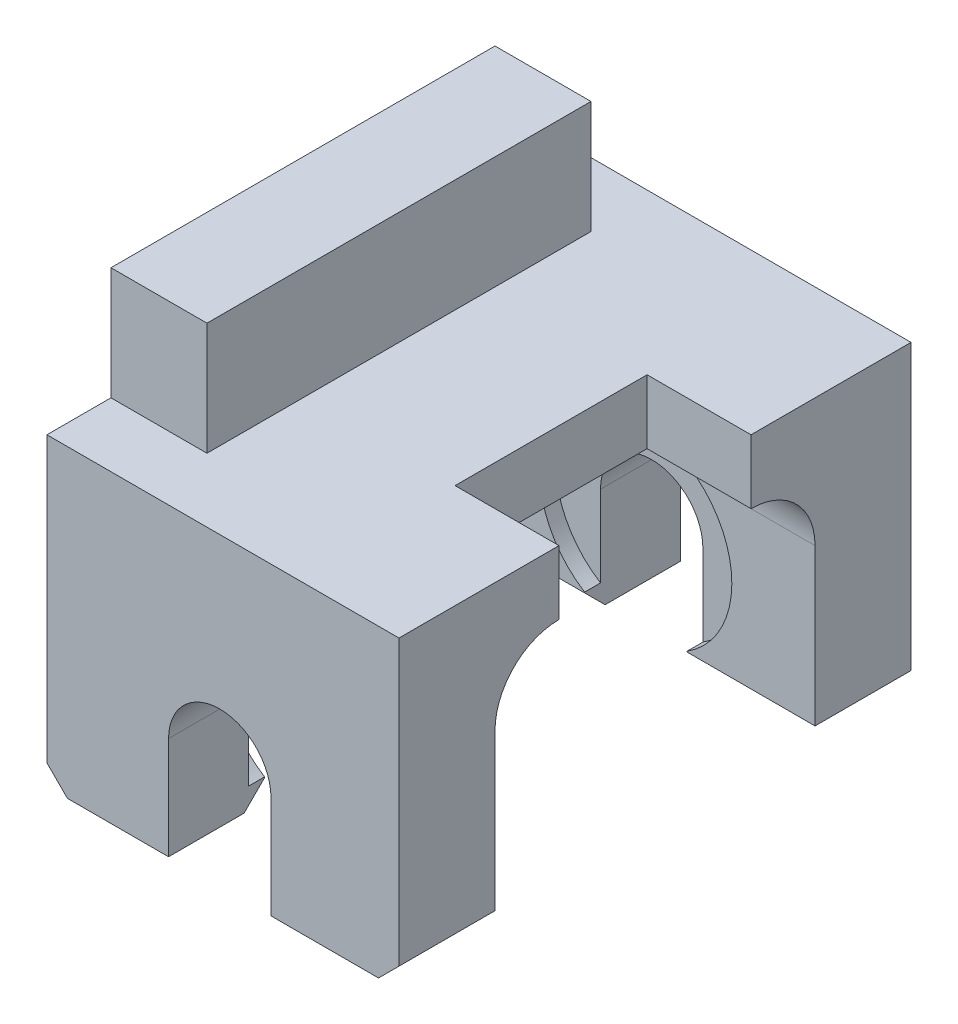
ISO-10303-21;
HEADER;
FILE_DESCRIPTION(('STEP AP214'),'2;1');
FILE_NAME('part.step','',(''),(''),'','','');
FILE_SCHEMA(('AUTOMOTIVE_DESIGN { 1 0 10303 214 1 1 1 1 }'));
ENDSEC;
DATA;
#1=APPLICATION_CONTEXT('core data for automotive mechanical design processes');
#2=APPLICATION_PROTOCOL_DEFINITION('international standard','automotive_design',2000,#1);
#3=PRODUCT_CONTEXT('',#1,'mechanical');
#4=PRODUCT('Part','Part','',(#3));
#5=PRODUCT_RELATED_PRODUCT_CATEGORY('part','',(#4));
#6=PRODUCT_DEFINITION_FORMATION('','',#4);
#7=PRODUCT_DEFINITION_CONTEXT('part definition',#1,'design');
#8=PRODUCT_DEFINITION('design','',#6,#7);
#9=PRODUCT_DEFINITION_SHAPE('','',#8);
#10=(LENGTH_UNIT() NAMED_UNIT(*) SI_UNIT(.MILLI.,.METRE.));
#11=(NAMED_UNIT(*) PLANE_ANGLE_UNIT() SI_UNIT($,.RADIAN.));
#12=(NAMED_UNIT(*) SI_UNIT($,.STERADIAN.) SOLID_ANGLE_UNIT());
#13=UNCERTAINTY_MEASURE_WITH_UNIT(LENGTH_MEASURE(1.E-05),#10,'distance_accuracy_value','');
#14=(GEOMETRIC_REPRESENTATION_CONTEXT(3) GLOBAL_UNCERTAINTY_ASSIGNED_CONTEXT((#13)) GLOBAL_UNIT_ASSIGNED_CONTEXT((#10,
#11,#12)) REPRESENTATION_CONTEXT('',''));
#15=CARTESIAN_POINT('',(0.,0.,0.));
#16=DIRECTION('',(0.,0.,1.));
#17=DIRECTION('',(1.,0.,0.));
#18=AXIS2_PLACEMENT_3D('',#15,#16,#17);
#19=CARTESIAN_POINT('',(-5.08,0.,25.4));
#20=DIRECTION('',(-1.,0.,0.));
#21=DIRECTION('',(0.,-1.,0.));
#22=AXIS2_PLACEMENT_3D('',#19,#20,#21);
#23=PLANE('',#22);
#24=DIRECTION('',(0.,0.,-1.));
#25=VECTOR('',#24,1.);
#26=CARTESIAN_POINT('',(-5.08,-8.05724673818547,17.4498));
#27=LINE('',#26,#25);
#28=CARTESIAN_POINT('',(-5.08,-8.05724673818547,17.4498));
#29=VERTEX_POINT('',#28);
#30=CARTESIAN_POINT('',(-5.08,-8.05724673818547,15.875));
#31=VERTEX_POINT('',#30);
#32=EDGE_CURVE('E683',#29,#31,#27,.T.);
#33=ORIENTED_EDGE('',*,*,#32,.F.);
#34=DIRECTION('',(0.,-1.,0.));
#35=VECTOR('',#34,1.);
#36=CARTESIAN_POINT('',(-5.08,0.,17.4498));
#37=LINE('',#36,#35);
#38=CARTESIAN_POINT('',(-5.08,0.,17.4498));
#39=VERTEX_POINT('',#38);
#40=EDGE_CURVE('E680',#39,#29,#37,.T.);
#41=ORIENTED_EDGE('',*,*,#40,.F.);
#42=DIRECTION('',(0.,0.,-1.));
#43=VECTOR('',#42,1.);
#44=CARTESIAN_POINT('',(-5.08,0.,25.4));
#45=LINE('',#44,#43);
#46=CARTESIAN_POINT('',(-5.08,0.,25.4));
#47=VERTEX_POINT('',#46);
#48=EDGE_CURVE('E509',#47,#39,#45,.T.);
#49=ORIENTED_EDGE('',*,*,#48,.F.);
#50=DIRECTION('',(0.,1.,0.));
#51=VECTOR('',#50,1.);
#52=CARTESIAN_POINT('',(-5.08,0.,25.4));
#53=LINE('',#52,#51);
#54=CARTESIAN_POINT('',(-5.08,-10.16,25.4));
#55=VERTEX_POINT('',#54);
#56=EDGE_CURVE('E473',#55,#47,#53,.T.);
#57=ORIENTED_EDGE('',*,*,#56,.F.);
#58=DIRECTION('',(0.,0.,-1.));
#59=VECTOR('',#58,1.);
#60=CARTESIAN_POINT('',(-5.08,-10.16,25.4));
#61=LINE('',#60,#59);
#62=CARTESIAN_POINT('',(-5.08,-10.16,17.907));
#63=VERTEX_POINT('',#62);
#64=EDGE_CURVE('E513',#55,#63,#61,.T.);
#65=ORIENTED_EDGE('',*,*,#64,.T.);
#66=DIRECTION('',(0.,-0.707106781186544,0.707106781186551));
#67=VECTOR('',#66,1.);
#68=CARTESIAN_POINT('',(-5.08,-10.16,17.907));
#69=LINE('',#68,#67);
#70=CARTESIAN_POINT('',(-5.08,-8.12799999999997,15.875));
#71=VERTEX_POINT('',#70);
#72=EDGE_CURVE('E342',#63,#71,#69,.F.);
#73=ORIENTED_EDGE('',*,*,#72,.T.);
#74=DIRECTION('',(0.,1.,0.));
#75=VECTOR('',#74,1.);
#76=CARTESIAN_POINT('',(-5.08,0.,15.875));
#77=LINE('',#76,#75);
#78=EDGE_CURVE('E448',#71,#31,#77,.T.);
#79=ORIENTED_EDGE('',*,*,#78,.T.);
#80=EDGE_LOOP('',(#33,#41,#49,#57,#65,#73,#79));
#81=FACE_BOUND('',#80,.T.);
#82=ADVANCED_FACE('F32',(#81),#23,.F.);
#83=CARTESIAN_POINT('',(0.,0.,25.4));
#84=DIRECTION('',(0.,0.,-1.));
#85=DIRECTION('',(-1.,0.,0.));
#86=AXIS2_PLACEMENT_3D('',#83,#84,#85);
#87=CYLINDRICAL_SURFACE('',#86,5.08);
#88=CARTESIAN_POINT('',(0.,0.,17.4498));
#89=DIRECTION('',(0.,0.,-1.));
#90=DIRECTION('',(-1.,0.,0.));
#91=AXIS2_PLACEMENT_3D('',#88,#89,#90);
#92=CIRCLE('',#91,5.08);
#93=CARTESIAN_POINT('',(5.08,0.,17.4498));
#94=VERTEX_POINT('',#93);
#95=EDGE_CURVE('E585',#94,#39,#92,.F.);
#96=ORIENTED_EDGE('',*,*,#95,.F.);
#97=DIRECTION('',(0.,0.,-1.));
#98=VECTOR('',#97,1.);
#99=CARTESIAN_POINT('',(5.08,0.,25.4));
#100=LINE('',#99,#98);
#101=CARTESIAN_POINT('',(5.08,0.,25.4));
#102=VERTEX_POINT('',#101);
#103=EDGE_CURVE('E505',#102,#94,#100,.T.);
#104=ORIENTED_EDGE('',*,*,#103,.F.);
#105=CARTESIAN_POINT('',(0.,0.,25.4));
#106=DIRECTION('',(0.,0.,-1.));
#107=DIRECTION('',(1.,0.,0.));
#108=AXIS2_PLACEMENT_3D('',#105,#106,#107);
#109=CIRCLE('',#108,5.08);
#110=EDGE_CURVE('E475',#47,#102,#109,.T.);
#111=ORIENTED_EDGE('',*,*,#110,.F.);
#112=ORIENTED_EDGE('',*,*,#48,.T.);
#113=EDGE_LOOP('',(#96,#104,#111,#112));
#114=FACE_BOUND('',#113,.T.);
#115=ADVANCED_FACE('F584',(#114),#87,.F.);
#116=CARTESIAN_POINT('',(5.08,0.,25.4));
#117=DIRECTION('',(1.,0.,0.));
#118=DIRECTION('',(0.,0.,-1.));
#119=AXIS2_PLACEMENT_3D('',#116,#117,#118);
#120=PLANE('',#119);
#121=DIRECTION('',(0.,0.,-1.));
#122=VECTOR('',#121,1.);
#123=CARTESIAN_POINT('',(5.08,-8.05724673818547,17.4498));
#124=LINE('',#123,#122);
#125=CARTESIAN_POINT('',(5.08,-8.05724673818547,15.875));
#126=VERTEX_POINT('',#125);
#127=CARTESIAN_POINT('',(5.08,-8.05724673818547,17.4498));
#128=VERTEX_POINT('',#127);
#129=EDGE_CURVE('E685',#126,#128,#124,.F.);
#130=ORIENTED_EDGE('',*,*,#129,.F.);
#131=DIRECTION('',(0.,-1.,0.));
#132=VECTOR('',#131,1.);
#133=CARTESIAN_POINT('',(5.08,0.,15.875));
#134=LINE('',#133,#132);
#135=CARTESIAN_POINT('',(5.08,-8.12799999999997,15.875));
#136=VERTEX_POINT('',#135);
#137=EDGE_CURVE('E292',#126,#136,#134,.T.);
#138=ORIENTED_EDGE('',*,*,#137,.T.);
#139=DIRECTION('',(0.,0.707106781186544,-0.707106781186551));
#140=VECTOR('',#139,1.);
#141=CARTESIAN_POINT('',(5.08,-10.16,17.907));
#142=LINE('',#141,#140);
#143=CARTESIAN_POINT('',(5.08,-10.16,17.907));
#144=VERTEX_POINT('',#143);
#145=EDGE_CURVE('E353',#136,#144,#142,.F.);
#146=ORIENTED_EDGE('',*,*,#145,.T.);
#147=DIRECTION('',(0.,0.,-1.));
#148=VECTOR('',#147,1.);
#149=CARTESIAN_POINT('',(5.08,-10.16,25.4));
#150=LINE('',#149,#148);
#151=CARTESIAN_POINT('',(5.08,-10.16,25.4));
#152=VERTEX_POINT('',#151);
#153=EDGE_CURVE('E501',#152,#144,#150,.T.);
#154=ORIENTED_EDGE('',*,*,#153,.F.);
#155=DIRECTION('',(0.,-1.,0.));
#156=VECTOR('',#155,1.);
#157=CARTESIAN_POINT('',(5.08,0.,25.4));
#158=LINE('',#157,#156);
#159=EDGE_CURVE('E477',#102,#152,#158,.T.);
#160=ORIENTED_EDGE('',*,*,#159,.F.);
#161=ORIENTED_EDGE('',*,*,#103,.T.);
#162=DIRECTION('',(0.,1.,0.));
#163=VECTOR('',#162,1.);
#164=CARTESIAN_POINT('',(5.08,0.,17.4498));
#165=LINE('',#164,#163);
#166=EDGE_CURVE('E11',#128,#94,#165,.T.);
#167=ORIENTED_EDGE('',*,*,#166,.F.);
#168=EDGE_LOOP('',(#130,#138,#146,#154,#160,#161,#167));
#169=FACE_BOUND('',#168,.T.);
#170=ADVANCED_FACE('F588',(#169),#120,.F.);
#171=CARTESIAN_POINT('',(-17.145,-10.16,15.875));
#172=DIRECTION('',(0.,0.,1.));
#173=DIRECTION('',(1.,0.,0.));
#174=AXIS2_PLACEMENT_3D('',#171,#172,#173);
#175=PLANE('',#174);
#176=CARTESIAN_POINT('',(0.,0.,15.875));
#177=DIRECTION('',(0.,0.,1.));
#178=DIRECTION('',(1.,0.,0.));
#179=AXIS2_PLACEMENT_3D('',#176,#177,#178);
#180=CIRCLE('',#179,9.525);
#181=CARTESIAN_POINT('',(-6.03884666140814,7.36599999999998,15.875));
#182=VERTEX_POINT('',#181);
#183=EDGE_CURVE('E283',#182,#31,#180,.T.);
#184=ORIENTED_EDGE('',*,*,#183,.T.);
#185=ORIENTED_EDGE('',*,*,#78,.F.);
#186=DIRECTION('',(-1.,0.,0.));
#187=VECTOR('',#186,1.);
#188=CARTESIAN_POINT('',(-17.145,-8.12799999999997,15.875));
#189=LINE('',#188,#187);
#190=CARTESIAN_POINT('',(-17.145,-8.12799999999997,15.875));
#191=VERTEX_POINT('',#190);
#192=EDGE_CURVE('E346',#71,#191,#189,.T.);
#193=ORIENTED_EDGE('',*,*,#192,.T.);
#194=DIRECTION('',(0.,-1.,0.));
#195=VECTOR('',#194,1.);
#196=CARTESIAN_POINT('',(-17.145,-10.16,15.875));
#197=LINE('',#196,#195);
#198=CARTESIAN_POINT('',(-17.145,7.36599999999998,15.875));
#199=VERTEX_POINT('',#198);
#200=EDGE_CURVE('E435',#199,#191,#197,.T.);
#201=ORIENTED_EDGE('',*,*,#200,.F.);
#202=DIRECTION('',(1.,0.,0.));
#203=VECTOR('',#202,1.);
#204=CARTESIAN_POINT('',(17.78,7.36600000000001,15.875));
#205=LINE('',#204,#203);
#206=EDGE_CURVE('E274',#199,#182,#205,.T.);
#207=ORIENTED_EDGE('',*,*,#206,.T.);
#208=EDGE_LOOP('',(#184,#185,#193,#201,#207));
#209=FACE_BOUND('',#208,.T.);
#210=ADVANCED_FACE('F553',(#209),#175,.F.);
#211=CARTESIAN_POINT('',(6.03884666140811,7.36600000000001,15.875));
#212=VERTEX_POINT('',#211);
#213=EDGE_CURVE('E280',#126,#212,#180,.T.);
#214=ORIENTED_EDGE('',*,*,#213,.T.);
#215=CARTESIAN_POINT('',(17.78,7.36600000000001,15.875));
#216=VERTEX_POINT('',#215);
#217=EDGE_CURVE('E275',#212,#216,#205,.T.);
#218=ORIENTED_EDGE('',*,*,#217,.T.);
#219=DIRECTION('',(0.,-1.,0.));
#220=VECTOR('',#219,1.);
#221=CARTESIAN_POINT('',(17.78,-10.16,15.875));
#222=LINE('',#221,#220);
#223=CARTESIAN_POINT('',(17.78,-8.12799999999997,15.875));
#224=VERTEX_POINT('',#223);
#225=EDGE_CURVE('E425',#216,#224,#222,.T.);
#226=ORIENTED_EDGE('',*,*,#225,.T.);
#227=DIRECTION('',(-1.,0.,0.));
#228=VECTOR('',#227,1.);
#229=CARTESIAN_POINT('',(-17.145,-8.12799999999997,15.875));
#230=LINE('',#229,#228);
#231=EDGE_CURVE('E344',#224,#136,#230,.T.);
#232=ORIENTED_EDGE('',*,*,#231,.T.);
#233=ORIENTED_EDGE('',*,*,#137,.F.);
#234=EDGE_LOOP('',(#214,#218,#226,#232,#233));
#235=FACE_BOUND('',#234,.T.);
#236=ADVANCED_FACE('F288',(#235),#175,.F.);
#237=CARTESIAN_POINT('',(0.,0.,-17.4498));
#238=DIRECTION('',(0.,0.,1.));
#239=DIRECTION('',(1.,0.,0.));
#240=AXIS2_PLACEMENT_3D('',#237,#238,#239);
#241=CIRCLE('',#240,5.08);
#242=CARTESIAN_POINT('',(-5.08,0.,-17.4498));
#243=VERTEX_POINT('',#242);
#244=CARTESIAN_POINT('',(5.08,0.,-17.4498));
#245=VERTEX_POINT('',#244);
#246=EDGE_CURVE('E380',#243,#245,#241,.F.);
#247=ORIENTED_EDGE('',*,*,#246,.F.);
#248=CARTESIAN_POINT('',(-5.08,0.,-25.4));
#249=VERTEX_POINT('',#248);
#250=EDGE_CURVE('E508',#243,#249,#45,.T.);
#251=ORIENTED_EDGE('',*,*,#250,.T.);
#252=CARTESIAN_POINT('',(0.,0.,-25.4));
#253=DIRECTION('',(0.,0.,-1.));
#254=DIRECTION('',(1.,0.,0.));
#255=AXIS2_PLACEMENT_3D('',#252,#253,#254);
#256=CIRCLE('',#255,5.08);
#257=CARTESIAN_POINT('',(5.08,0.,-25.4));
#258=VERTEX_POINT('',#257);
#259=EDGE_CURVE('E456',#249,#258,#256,.T.);
#260=ORIENTED_EDGE('',*,*,#259,.T.);
#261=EDGE_CURVE('E504',#245,#258,#100,.T.);
#262=ORIENTED_EDGE('',*,*,#261,.F.);
#263=EDGE_LOOP('',(#247,#251,#260,#262));
#264=FACE_BOUND('',#263,.T.);
#265=ADVANCED_FACE('F622',(#264),#87,.F.);
#266=CARTESIAN_POINT('',(-17.145,13.716,-15.875));
#267=DIRECTION('',(0.,0.,-1.));
#268=DIRECTION('',(0.,1.,0.));
#269=AXIS2_PLACEMENT_3D('',#266,#267,#268);
#270=PLANE('',#269);
#271=DIRECTION('',(1.,0.,0.));
#272=VECTOR('',#271,1.);
#273=CARTESIAN_POINT('',(-17.145,7.36600000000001,-15.875));
#274=LINE('',#273,#272);
#275=CARTESIAN_POINT('',(17.78,7.36600000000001,-15.875));
#276=VERTEX_POINT('',#275);
#277=CARTESIAN_POINT('',(6.03884666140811,7.36600000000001,-15.875));
#278=VERTEX_POINT('',#277);
#279=EDGE_CURVE('E298',#276,#278,#274,.F.);
#280=ORIENTED_EDGE('',*,*,#279,.T.);
#281=CARTESIAN_POINT('',(0.,0.,-15.875));
#282=DIRECTION('',(0.,0.,1.));
#283=DIRECTION('',(1.,0.,0.));
#284=AXIS2_PLACEMENT_3D('',#281,#282,#283);
#285=CIRCLE('',#284,9.525);
#286=CARTESIAN_POINT('',(5.08,-8.05724673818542,-15.875));
#287=VERTEX_POINT('',#286);
#288=EDGE_CURVE('E541',#287,#278,#285,.T.);
#289=ORIENTED_EDGE('',*,*,#288,.F.);
#290=DIRECTION('',(0.,1.,0.));
#291=VECTOR('',#290,1.);
#292=CARTESIAN_POINT('',(5.08,0.,-15.875));
#293=LINE('',#292,#291);
#294=CARTESIAN_POINT('',(5.08,-8.12799999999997,-15.875));
#295=VERTEX_POINT('',#294);
#296=EDGE_CURVE('E396',#295,#287,#293,.T.);
#297=ORIENTED_EDGE('',*,*,#296,.F.);
#298=DIRECTION('',(1.,0.,0.));
#299=VECTOR('',#298,1.);
#300=CARTESIAN_POINT('',(-17.145,-8.12799999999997,-15.875));
#301=LINE('',#300,#299);
#302=CARTESIAN_POINT('',(17.78,-8.12799999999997,-15.875));
#303=VERTEX_POINT('',#302);
#304=EDGE_CURVE('E319',#295,#303,#301,.T.);
#305=ORIENTED_EDGE('',*,*,#304,.T.);
#306=DIRECTION('',(0.,1.,0.));
#307=VECTOR('',#306,1.);
#308=CARTESIAN_POINT('',(17.78,13.716,-15.875));
#309=LINE('',#308,#307);
#310=EDGE_CURVE('E433',#303,#276,#309,.T.);
#311=ORIENTED_EDGE('',*,*,#310,.T.);
#312=EDGE_LOOP('',(#280,#289,#297,#305,#311));
#313=FACE_BOUND('',#312,.T.);
#314=ADVANCED_FACE('F656',(#313),#270,.F.);
#315=CARTESIAN_POINT('',(17.78,20.066,25.4));
#316=DIRECTION('',(-1.,0.,0.));
#317=DIRECTION('',(0.,-1.,0.));
#318=AXIS2_PLACEMENT_3D('',#315,#316,#317);
#319=PLANE('',#318);
#320=ORIENTED_EDGE('',*,*,#310,.F.);
#321=DIRECTION('',(0.,0.,-1.));
#322=VECTOR('',#321,1.);
#323=CARTESIAN_POINT('',(17.78,-8.12799999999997,25.4));
#324=LINE('',#323,#322);
#325=CARTESIAN_POINT('',(17.78,-8.12799999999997,-25.4));
#326=VERTEX_POINT('',#325);
#327=EDGE_CURVE('E366',#303,#326,#324,.T.);
#328=ORIENTED_EDGE('',*,*,#327,.T.);
#329=DIRECTION('',(0.,1.,0.));
#330=VECTOR('',#329,1.);
#331=CARTESIAN_POINT('',(17.78,20.066,-25.4));
#332=LINE('',#331,#330);
#333=CARTESIAN_POINT('',(17.78,20.066,-25.4));
#334=VERTEX_POINT('',#333);
#335=EDGE_CURVE('E465',#326,#334,#332,.T.);
#336=ORIENTED_EDGE('',*,*,#335,.T.);
#337=DIRECTION('',(0.,0.,-1.));
#338=VECTOR('',#337,1.);
#339=CARTESIAN_POINT('',(17.78,20.066,25.4));
#340=LINE('',#339,#338);
#341=CARTESIAN_POINT('',(17.78,20.066,-9.52500000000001));
#342=VERTEX_POINT('',#341);
#343=EDGE_CURVE('E496',#342,#334,#340,.T.);
#344=ORIENTED_EDGE('',*,*,#343,.F.);
#345=DIRECTION('',(0.,1.,0.));
#346=VECTOR('',#345,1.);
#347=CARTESIAN_POINT('',(17.78,-10.16,-9.525));
#348=LINE('',#347,#346);
#349=CARTESIAN_POINT('',(17.78,13.716,-9.525));
#350=VERTEX_POINT('',#349);
#351=EDGE_CURVE('E423',#350,#342,#348,.T.);
#352=ORIENTED_EDGE('',*,*,#351,.F.);
#353=CARTESIAN_POINT('',(17.78,7.36600000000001,-9.525));
#354=DIRECTION('',(-1.,0.,0.));
#355=DIRECTION('',(0.,-1.,0.));
#356=AXIS2_PLACEMENT_3D('',#353,#354,#355);
#357=CIRCLE('',#356,6.35);
#358=EDGE_CURVE('E304',#350,#276,#357,.T.);
#359=ORIENTED_EDGE('',*,*,#358,.T.);
#360=EDGE_LOOP('',(#320,#328,#336,#344,#352,#359));
#361=FACE_BOUND('',#360,.T.);
#362=ADVANCED_FACE('F788',(#361),#319,.F.);
#363=CARTESIAN_POINT('',(-5.08,-10.16,25.4));
#364=DIRECTION('',(0.,1.,0.));
#365=DIRECTION('',(0.,0.,1.));
#366=AXIS2_PLACEMENT_3D('',#363,#364,#365);
#367=PLANE('',#366);
#368=DIRECTION('',(0.,0.,-1.));
#369=VECTOR('',#368,1.);
#370=CARTESIAN_POINT('',(-15.113,-10.16,25.4));
#371=LINE('',#370,#369);
#372=CARTESIAN_POINT('',(-15.113,-10.16,25.4));
#373=VERTEX_POINT('',#372);
#374=CARTESIAN_POINT('',(-15.113,-10.16,17.907));
#375=VERTEX_POINT('',#374);
#376=EDGE_CURVE('E337',#373,#375,#371,.T.);
#377=ORIENTED_EDGE('',*,*,#376,.T.);
#378=DIRECTION('',(1.,0.,0.));
#379=VECTOR('',#378,1.);
#380=CARTESIAN_POINT('',(-5.08,-10.16,17.907));
#381=LINE('',#380,#379);
#382=EDGE_CURVE('E339',#375,#63,#381,.T.);
#383=ORIENTED_EDGE('',*,*,#382,.T.);
#384=ORIENTED_EDGE('',*,*,#64,.F.);
#385=DIRECTION('',(1.,0.,0.));
#386=VECTOR('',#385,1.);
#387=CARTESIAN_POINT('',(-5.08,-10.16,25.4));
#388=LINE('',#387,#386);
#389=EDGE_CURVE('E471',#373,#55,#388,.T.);
#390=ORIENTED_EDGE('',*,*,#389,.F.);
#391=EDGE_LOOP('',(#377,#383,#384,#390));
#392=FACE_BOUND('',#391,.T.);
#393=ADVANCED_FACE('F573',(#392),#367,.F.);
#394=CARTESIAN_POINT('',(17.78,-10.16,25.4));
#395=DIRECTION('',(0.,1.,0.));
#396=DIRECTION('',(-1.,0.,0.));
#397=AXIS2_PLACEMENT_3D('',#394,#395,#396);
#398=PLANE('',#397);
#399=ORIENTED_EDGE('',*,*,#153,.T.);
#400=DIRECTION('',(1.,0.,0.));
#401=VECTOR('',#400,1.);
#402=CARTESIAN_POINT('',(17.78,-10.16,17.907));
#403=LINE('',#402,#401);
#404=CARTESIAN_POINT('',(15.748,-10.16,17.907));
#405=VERTEX_POINT('',#404);
#406=EDGE_CURVE('E350',#144,#405,#403,.T.);
#407=ORIENTED_EDGE('',*,*,#406,.T.);
#408=DIRECTION('',(0.,0.,1.));
#409=VECTOR('',#408,1.);
#410=CARTESIAN_POINT('',(15.748,-10.16,25.4));
#411=LINE('',#410,#409);
#412=CARTESIAN_POINT('',(15.748,-10.16,25.4));
#413=VERTEX_POINT('',#412);
#414=EDGE_CURVE('E348',#405,#413,#411,.T.);
#415=ORIENTED_EDGE('',*,*,#414,.T.);
#416=DIRECTION('',(1.,0.,0.));
#417=VECTOR('',#416,1.);
#418=CARTESIAN_POINT('',(17.78,-10.16,25.4));
#419=LINE('',#418,#417);
#420=EDGE_CURVE('E479',#152,#413,#419,.T.);
#421=ORIENTED_EDGE('',*,*,#420,.F.);
#422=EDGE_LOOP('',(#399,#407,#415,#421));
#423=FACE_BOUND('',#422,.T.);
#424=ADVANCED_FACE('F593',(#423),#398,.F.);
#425=CARTESIAN_POINT('',(-5.08,-10.16,-17.907));
#426=VERTEX_POINT('',#425);
#427=CARTESIAN_POINT('',(-5.08,-10.16,-25.4));
#428=VERTEX_POINT('',#427);
#429=EDGE_CURVE('E512',#426,#428,#61,.T.);
#430=ORIENTED_EDGE('',*,*,#429,.F.);
#431=DIRECTION('',(-1.,0.,0.));
#432=VECTOR('',#431,1.);
#433=CARTESIAN_POINT('',(-5.08,-10.16,-17.907));
#434=LINE('',#433,#432);
#435=CARTESIAN_POINT('',(-15.113,-10.16,-17.907));
#436=VERTEX_POINT('',#435);
#437=EDGE_CURVE('E329',#426,#436,#434,.T.);
#438=ORIENTED_EDGE('',*,*,#437,.T.);
#439=DIRECTION('',(0.,0.,-1.));
#440=VECTOR('',#439,1.);
#441=CARTESIAN_POINT('',(-15.113,-10.16,25.4));
#442=LINE('',#441,#440);
#443=CARTESIAN_POINT('',(-15.113,-10.16,-25.4));
#444=VERTEX_POINT('',#443);
#445=EDGE_CURVE('E327',#436,#444,#442,.T.);
#446=ORIENTED_EDGE('',*,*,#445,.T.);
#447=DIRECTION('',(1.,0.,0.));
#448=VECTOR('',#447,1.);
#449=CARTESIAN_POINT('',(-5.08,-10.16,-25.4));
#450=LINE('',#449,#448);
#451=EDGE_CURVE('E451',#444,#428,#450,.T.);
#452=ORIENTED_EDGE('',*,*,#451,.T.);
#453=EDGE_LOOP('',(#430,#438,#446,#452));
#454=FACE_BOUND('',#453,.T.);
#455=ADVANCED_FACE('F34',(#454),#367,.F.);
#456=DIRECTION('',(0.,1.,0.));
#457=VECTOR('',#456,1.);
#458=CARTESIAN_POINT('',(-5.08,0.,-17.4498));
#459=LINE('',#458,#457);
#460=CARTESIAN_POINT('',(-5.08,-8.05724673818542,-17.4498));
#461=VERTEX_POINT('',#460);
#462=EDGE_CURVE('E402',#461,#243,#459,.T.);
#463=ORIENTED_EDGE('',*,*,#462,.F.);
#464=DIRECTION('',(0.,0.,1.));
#465=VECTOR('',#464,1.);
#466=CARTESIAN_POINT('',(-5.08,-8.05724673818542,-17.4498));
#467=LINE('',#466,#465);
#468=CARTESIAN_POINT('',(-5.08,-8.05724673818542,-15.875));
#469=VERTEX_POINT('',#468);
#470=EDGE_CURVE('E390',#461,#469,#467,.T.);
#471=ORIENTED_EDGE('',*,*,#470,.T.);
#472=DIRECTION('',(0.,-1.,0.));
#473=VECTOR('',#472,1.);
#474=CARTESIAN_POINT('',(-5.08,0.,-15.875));
#475=LINE('',#474,#473);
#476=CARTESIAN_POINT('',(-5.08,-8.12799999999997,-15.875));
#477=VERTEX_POINT('',#476);
#478=EDGE_CURVE('E445',#469,#477,#475,.T.);
#479=ORIENTED_EDGE('',*,*,#478,.T.);
#480=DIRECTION('',(0.,0.707106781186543,0.707106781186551));
#481=VECTOR('',#480,1.);
#482=CARTESIAN_POINT('',(-5.08,-8.12799999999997,-15.875));
#483=LINE('',#482,#481);
#484=EDGE_CURVE('E325',#477,#426,#483,.F.);
#485=ORIENTED_EDGE('',*,*,#484,.T.);
#486=ORIENTED_EDGE('',*,*,#429,.T.);
#487=DIRECTION('',(0.,1.,0.));
#488=VECTOR('',#487,1.);
#489=CARTESIAN_POINT('',(-5.08,0.,-25.4));
#490=LINE('',#489,#488);
#491=EDGE_CURVE('E453',#428,#249,#490,.T.);
#492=ORIENTED_EDGE('',*,*,#491,.T.);
#493=ORIENTED_EDGE('',*,*,#250,.F.);
#494=EDGE_LOOP('',(#463,#471,#479,#485,#486,#492,#493));
#495=FACE_BOUND('',#494,.T.);
#496=ADVANCED_FACE('F617',(#495),#23,.F.);
#497=ORIENTED_EDGE('',*,*,#296,.T.);
#498=DIRECTION('',(0.,0.,1.));
#499=VECTOR('',#498,1.);
#500=CARTESIAN_POINT('',(5.08,-8.05724673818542,-17.4498));
#501=LINE('',#500,#499);
#502=CARTESIAN_POINT('',(5.08,-8.05724673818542,-17.4498));
#503=VERTEX_POINT('',#502);
#504=EDGE_CURVE('E387',#287,#503,#501,.F.);
#505=ORIENTED_EDGE('',*,*,#504,.T.);
#506=DIRECTION('',(0.,-1.,0.));
#507=VECTOR('',#506,1.);
#508=CARTESIAN_POINT('',(5.08,0.,-17.4498));
#509=LINE('',#508,#507);
#510=EDGE_CURVE('E40',#245,#503,#509,.T.);
#511=ORIENTED_EDGE('',*,*,#510,.F.);
#512=ORIENTED_EDGE('',*,*,#261,.T.);
#513=DIRECTION('',(0.,-1.,0.));
#514=VECTOR('',#513,1.);
#515=CARTESIAN_POINT('',(5.08,0.,-25.4));
#516=LINE('',#515,#514);
#517=CARTESIAN_POINT('',(5.08,-10.16,-25.4));
#518=VERTEX_POINT('',#517);
#519=EDGE_CURVE('E459',#258,#518,#516,.T.);
#520=ORIENTED_EDGE('',*,*,#519,.T.);
#521=CARTESIAN_POINT('',(5.08,-10.16,-17.907));
#522=VERTEX_POINT('',#521);
#523=EDGE_CURVE('E500',#522,#518,#150,.T.);
#524=ORIENTED_EDGE('',*,*,#523,.F.);
#525=DIRECTION('',(0.,-0.707106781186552,-0.707106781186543));
#526=VECTOR('',#525,1.);
#527=CARTESIAN_POINT('',(5.08,-8.12799999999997,-15.875));
#528=LINE('',#527,#526);
#529=EDGE_CURVE('E335',#522,#295,#528,.F.);
#530=ORIENTED_EDGE('',*,*,#529,.T.);
#531=EDGE_LOOP('',(#497,#505,#511,#512,#520,#524,#530));
#532=FACE_BOUND('',#531,.T.);
#533=ADVANCED_FACE('F394',(#532),#120,.F.);
#534=DIRECTION('',(0.,0.,1.));
#535=VECTOR('',#534,1.);
#536=CARTESIAN_POINT('',(15.748,-10.16,25.4));
#537=LINE('',#536,#535);
#538=CARTESIAN_POINT('',(15.748,-10.16,-25.4));
#539=VERTEX_POINT('',#538);
#540=CARTESIAN_POINT('',(15.748,-10.16,-17.907));
#541=VERTEX_POINT('',#540);
#542=EDGE_CURVE('E331',#539,#541,#537,.T.);
#543=ORIENTED_EDGE('',*,*,#542,.T.);
#544=DIRECTION('',(-1.,0.,0.));
#545=VECTOR('',#544,1.);
#546=CARTESIAN_POINT('',(17.78,-10.16,-17.907));
#547=LINE('',#546,#545);
#548=EDGE_CURVE('E333',#541,#522,#547,.T.);
#549=ORIENTED_EDGE('',*,*,#548,.T.);
#550=ORIENTED_EDGE('',*,*,#523,.T.);
#551=DIRECTION('',(1.,0.,0.));
#552=VECTOR('',#551,1.);
#553=CARTESIAN_POINT('',(17.78,-10.16,-25.4));
#554=LINE('',#553,#552);
#555=EDGE_CURVE('E462',#518,#539,#554,.T.);
#556=ORIENTED_EDGE('',*,*,#555,.T.);
#557=EDGE_LOOP('',(#543,#549,#550,#556));
#558=FACE_BOUND('',#557,.T.);
#559=ADVANCED_FACE('F629',(#558),#398,.F.);
#560=DIRECTION('',(0.,1.,0.));
#561=VECTOR('',#560,1.);
#562=CARTESIAN_POINT('',(17.78,20.066,25.4));
#563=LINE('',#562,#561);
#564=CARTESIAN_POINT('',(17.78,-8.12799999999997,25.4));
#565=VERTEX_POINT('',#564);
#566=CARTESIAN_POINT('',(17.78,20.066,25.4));
#567=VERTEX_POINT('',#566);
#568=EDGE_CURVE('E482',#565,#567,#563,.T.);
#569=ORIENTED_EDGE('',*,*,#568,.F.);
#570=DIRECTION('',(0.,0.,-1.));
#571=VECTOR('',#570,1.);
#572=CARTESIAN_POINT('',(17.78,-8.12799999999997,25.4));
#573=LINE('',#572,#571);
#574=EDGE_CURVE('E364',#565,#224,#573,.T.);
#575=ORIENTED_EDGE('',*,*,#574,.T.);
#576=ORIENTED_EDGE('',*,*,#225,.F.);
#577=CARTESIAN_POINT('',(17.78,7.36600000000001,9.525));
#578=DIRECTION('',(-1.,0.,0.));
#579=DIRECTION('',(0.,-1.,0.));
#580=AXIS2_PLACEMENT_3D('',#577,#578,#579);
#581=CIRCLE('',#580,6.35);
#582=CARTESIAN_POINT('',(17.78,13.716,9.52499999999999));
#583=VERTEX_POINT('',#582);
#584=EDGE_CURVE('E296',#216,#583,#581,.T.);
#585=ORIENTED_EDGE('',*,*,#584,.T.);
#586=DIRECTION('',(0.,1.,0.));
#587=VECTOR('',#586,1.);
#588=CARTESIAN_POINT('',(17.78,-10.16,9.525));
#589=LINE('',#588,#587);
#590=CARTESIAN_POINT('',(17.78,20.066,9.52499999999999));
#591=VERTEX_POINT('',#590);
#592=EDGE_CURVE('E426',#583,#591,#589,.T.);
#593=ORIENTED_EDGE('',*,*,#592,.T.);
#594=EDGE_CURVE('E497',#567,#591,#340,.T.);
#595=ORIENTED_EDGE('',*,*,#594,.F.);
#596=EDGE_LOOP('',(#569,#575,#576,#585,#593,#595));
#597=FACE_BOUND('',#596,.T.);
#598=ADVANCED_FACE('F602',(#597),#319,.F.);
#599=CARTESIAN_POINT('',(-7.62000000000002,20.066,25.4));
#600=DIRECTION('',(0.,-1.,0.));
#601=DIRECTION('',(0.,0.,-1.));
#602=AXIS2_PLACEMENT_3D('',#599,#600,#601);
#603=PLANE('',#602);
#604=DIRECTION('',(0.,0.,1.));
#605=VECTOR('',#604,1.);
#606=CARTESIAN_POINT('',(7.46759999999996,20.066,-9.52500000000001));
#607=LINE('',#606,#605);
#608=CARTESIAN_POINT('',(7.46759999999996,20.066,-9.52500000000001));
#609=VERTEX_POINT('',#608);
#610=CARTESIAN_POINT('',(7.46759999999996,20.066,9.52499999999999));
#611=VERTEX_POINT('',#610);
#612=EDGE_CURVE('E417',#609,#611,#607,.T.);
#613=ORIENTED_EDGE('',*,*,#612,.F.);
#614=DIRECTION('',(-1.,0.,0.));
#615=VECTOR('',#614,1.);
#616=CARTESIAN_POINT('',(17.78,20.066,-9.52500000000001));
#617=LINE('',#616,#615);
#618=EDGE_CURVE('E414',#342,#609,#617,.T.);
#619=ORIENTED_EDGE('',*,*,#618,.F.);
#620=ORIENTED_EDGE('',*,*,#343,.T.);
#621=DIRECTION('',(-1.,0.,0.));
#622=VECTOR('',#621,1.);
#623=CARTESIAN_POINT('',(-7.62000000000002,20.066,-25.4));
#624=LINE('',#623,#622);
#625=CARTESIAN_POINT('',(-17.145,20.066,-25.4));
#626=VERTEX_POINT('',#625);
#627=EDGE_CURVE('E467',#334,#626,#624,.T.);
#628=ORIENTED_EDGE('',*,*,#627,.T.);
#629=DIRECTION('',(0.,0.,-1.));
#630=VECTOR('',#629,1.);
#631=CARTESIAN_POINT('',(-17.145,20.066,-19.05));
#632=LINE('',#631,#630);
#633=CARTESIAN_POINT('',(-17.145,20.066,-19.05));
#634=VERTEX_POINT('',#633);
#635=EDGE_CURVE('E674',#634,#626,#632,.T.);
#636=ORIENTED_EDGE('',*,*,#635,.F.);
#637=DIRECTION('',(1.,0.,0.));
#638=VECTOR('',#637,1.);
#639=CARTESIAN_POINT('',(-17.145,20.066,-19.05));
#640=LINE('',#639,#638);
#641=CARTESIAN_POINT('',(-7.62000000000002,20.066,-19.05));
#642=VERTEX_POINT('',#641);
#643=EDGE_CURVE('E668',#634,#642,#640,.T.);
#644=ORIENTED_EDGE('',*,*,#643,.T.);
#645=DIRECTION('',(0.,0.,-1.));
#646=VECTOR('',#645,1.);
#647=CARTESIAN_POINT('',(-7.62000000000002,20.066,25.4));
#648=LINE('',#647,#646);
#649=CARTESIAN_POINT('',(-7.62000000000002,20.066,19.05));
#650=VERTEX_POINT('',#649);
#651=EDGE_CURVE('E493',#650,#642,#648,.T.);
#652=ORIENTED_EDGE('',*,*,#651,.F.);
#653=DIRECTION('',(1.,0.,0.));
#654=VECTOR('',#653,1.);
#655=CARTESIAN_POINT('',(-17.145,20.066,19.05));
#656=LINE('',#655,#654);
#657=CARTESIAN_POINT('',(-17.145,20.066,19.05));
#658=VERTEX_POINT('',#657);
#659=EDGE_CURVE('E659',#658,#650,#656,.T.);
#660=ORIENTED_EDGE('',*,*,#659,.F.);
#661=DIRECTION('',(0.,0.,-1.));
#662=VECTOR('',#661,1.);
#663=CARTESIAN_POINT('',(-17.145,20.066,25.4));
#664=LINE('',#663,#662);
#665=CARTESIAN_POINT('',(-17.145,20.066,25.4));
#666=VERTEX_POINT('',#665);
#667=EDGE_CURVE('E567',#666,#658,#664,.T.);
#668=ORIENTED_EDGE('',*,*,#667,.F.);
#669=DIRECTION('',(-1.,0.,0.));
#670=VECTOR('',#669,1.);
#671=CARTESIAN_POINT('',(-7.62000000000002,20.066,25.4));
#672=LINE('',#671,#670);
#673=EDGE_CURVE('E54',#567,#666,#672,.T.);
#674=ORIENTED_EDGE('',*,*,#673,.F.);
#675=ORIENTED_EDGE('',*,*,#594,.T.);
#676=DIRECTION('',(1.,0.,0.));
#677=VECTOR('',#676,1.);
#678=CARTESIAN_POINT('',(7.46759999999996,20.066,9.52499999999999));
#679=LINE('',#678,#677);
#680=EDGE_CURVE('E420',#611,#591,#679,.T.);
#681=ORIENTED_EDGE('',*,*,#680,.F.);
#682=EDGE_LOOP('',(#613,#619,#620,#628,#636,#644,#652,#660,#668,#674,#675,#681));
#683=FACE_BOUND('',#682,.T.);
#684=ADVANCED_FACE('F848',(#683),#603,.F.);
#685=CARTESIAN_POINT('',(-7.62000000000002,31.242,25.4));
#686=DIRECTION('',(-1.,0.,0.));
#687=DIRECTION('',(0.,-1.,0.));
#688=AXIS2_PLACEMENT_3D('',#685,#686,#687);
#689=PLANE('',#688);
#690=ORIENTED_EDGE('',*,*,#651,.T.);
#691=DIRECTION('',(0.,-1.,0.));
#692=VECTOR('',#691,1.);
#693=CARTESIAN_POINT('',(-7.62000000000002,20.066,-19.05));
#694=LINE('',#693,#692);
#695=CARTESIAN_POINT('',(-7.62000000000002,31.242,-19.05));
#696=VERTEX_POINT('',#695);
#697=EDGE_CURVE('E677',#696,#642,#694,.T.);
#698=ORIENTED_EDGE('',*,*,#697,.F.);
#699=DIRECTION('',(0.,0.,-1.));
#700=VECTOR('',#699,1.);
#701=CARTESIAN_POINT('',(-7.62000000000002,31.242,25.4));
#702=LINE('',#701,#700);
#703=CARTESIAN_POINT('',(-7.62000000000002,31.242,19.05));
#704=VERTEX_POINT('',#703);
#705=EDGE_CURVE('E490',#704,#696,#702,.T.);
#706=ORIENTED_EDGE('',*,*,#705,.F.);
#707=DIRECTION('',(0.,1.,0.));
#708=VECTOR('',#707,1.);
#709=CARTESIAN_POINT('',(-7.62000000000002,20.066,19.05));
#710=LINE('',#709,#708);
#711=EDGE_CURVE('E666',#650,#704,#710,.T.);
#712=ORIENTED_EDGE('',*,*,#711,.F.);
#713=EDGE_LOOP('',(#690,#698,#706,#712));
#714=FACE_BOUND('',#713,.T.);
#715=ADVANCED_FACE('F857',(#714),#689,.F.);
#716=CARTESIAN_POINT('',(-17.145,31.242,25.4));
#717=DIRECTION('',(0.,-1.,0.));
#718=DIRECTION('',(0.,0.,-1.));
#719=AXIS2_PLACEMENT_3D('',#716,#717,#718);
#720=PLANE('',#719);
#721=ORIENTED_EDGE('',*,*,#705,.T.);
#722=DIRECTION('',(1.,0.,0.));
#723=VECTOR('',#722,1.);
#724=CARTESIAN_POINT('',(-17.145,31.242,-19.05));
#725=LINE('',#724,#723);
#726=CARTESIAN_POINT('',(-17.145,31.242,-19.05));
#727=VERTEX_POINT('',#726);
#728=EDGE_CURVE('E669',#727,#696,#725,.T.);
#729=ORIENTED_EDGE('',*,*,#728,.F.);
#730=DIRECTION('',(0.,0.,-1.));
#731=VECTOR('',#730,1.);
#732=CARTESIAN_POINT('',(-17.145,31.242,25.4));
#733=LINE('',#732,#731);
#734=CARTESIAN_POINT('',(-17.145,31.242,19.05));
#735=VERTEX_POINT('',#734);
#736=EDGE_CURVE('E487',#735,#727,#733,.T.);
#737=ORIENTED_EDGE('',*,*,#736,.F.);
#738=DIRECTION('',(1.,0.,0.));
#739=VECTOR('',#738,1.);
#740=CARTESIAN_POINT('',(-17.145,31.242,19.05));
#741=LINE('',#740,#739);
#742=EDGE_CURVE('E657',#735,#704,#741,.T.);
#743=ORIENTED_EDGE('',*,*,#742,.T.);
#744=EDGE_LOOP('',(#721,#729,#737,#743));
#745=FACE_BOUND('',#744,.T.);
#746=ADVANCED_FACE('F868',(#745),#720,.F.);
#747=CARTESIAN_POINT('',(-17.145,-10.16,25.4));
#748=DIRECTION('',(1.,0.,0.));
#749=DIRECTION('',(0.,0.,-1.));
#750=AXIS2_PLACEMENT_3D('',#747,#748,#749);
#751=PLANE('',#750);
#752=DIRECTION('',(0.,-1.,0.));
#753=VECTOR('',#752,1.);
#754=CARTESIAN_POINT('',(-17.145,20.066,-19.05));
#755=LINE('',#754,#753);
#756=EDGE_CURVE('E671',#727,#634,#755,.T.);
#757=ORIENTED_EDGE('',*,*,#756,.T.);
#758=ORIENTED_EDGE('',*,*,#635,.T.);
#759=DIRECTION('',(0.,-1.,0.));
#760=VECTOR('',#759,1.);
#761=CARTESIAN_POINT('',(-17.145,-10.16,-25.4));
#762=LINE('',#761,#760);
#763=CARTESIAN_POINT('',(-17.145,-8.12799999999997,-25.4));
#764=VERTEX_POINT('',#763);
#765=EDGE_CURVE('E469',#626,#764,#762,.T.);
#766=ORIENTED_EDGE('',*,*,#765,.T.);
#767=DIRECTION('',(0.,0.,1.));
#768=VECTOR('',#767,1.);
#769=CARTESIAN_POINT('',(-17.145,-8.12799999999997,25.4));
#770=LINE('',#769,#768);
#771=CARTESIAN_POINT('',(-17.145,-8.12799999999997,-15.875));
#772=VERTEX_POINT('',#771);
#773=EDGE_CURVE('E355',#764,#772,#770,.T.);
#774=ORIENTED_EDGE('',*,*,#773,.T.);
#775=DIRECTION('',(0.,1.,0.));
#776=VECTOR('',#775,1.);
#777=CARTESIAN_POINT('',(-17.145,13.716,-15.875));
#778=LINE('',#777,#776);
#779=CARTESIAN_POINT('',(-17.145,7.36600000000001,-15.875));
#780=VERTEX_POINT('',#779);
#781=EDGE_CURVE('E438',#772,#780,#778,.T.);
#782=ORIENTED_EDGE('',*,*,#781,.T.);
#783=CARTESIAN_POINT('',(-17.145,7.36600000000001,-9.525));
#784=DIRECTION('',(1.,0.,0.));
#785=DIRECTION('',(0.,0.,-1.));
#786=AXIS2_PLACEMENT_3D('',#783,#784,#785);
#787=CIRCLE('',#786,6.35);
#788=CARTESIAN_POINT('',(-17.145,13.716,-9.525));
#789=VERTEX_POINT('',#788);
#790=EDGE_CURVE('E308',#780,#789,#787,.T.);
#791=ORIENTED_EDGE('',*,*,#790,.T.);
#792=DIRECTION('',(0.,0.,1.));
#793=VECTOR('',#792,1.);
#794=CARTESIAN_POINT('',(-17.145,13.716,15.875));
#795=LINE('',#794,#793);
#796=CARTESIAN_POINT('',(-17.145,13.716,9.525));
#797=VERTEX_POINT('',#796);
#798=EDGE_CURVE('E441',#789,#797,#795,.T.);
#799=ORIENTED_EDGE('',*,*,#798,.T.);
#800=CARTESIAN_POINT('',(-17.145,7.36600000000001,9.525));
#801=DIRECTION('',(1.,0.,0.));
#802=DIRECTION('',(0.,0.,-1.));
#803=AXIS2_PLACEMENT_3D('',#800,#801,#802);
#804=CIRCLE('',#803,6.35);
#805=EDGE_CURVE('E317',#797,#199,#804,.T.);
#806=ORIENTED_EDGE('',*,*,#805,.T.);
#807=ORIENTED_EDGE('',*,*,#200,.T.);
#808=DIRECTION('',(0.,0.,1.));
#809=VECTOR('',#808,1.);
#810=CARTESIAN_POINT('',(-17.145,-8.12799999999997,25.4));
#811=LINE('',#810,#809);
#812=CARTESIAN_POINT('',(-17.145,-8.12800000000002,25.4));
#813=VERTEX_POINT('',#812);
#814=EDGE_CURVE('E357',#191,#813,#811,.T.);
#815=ORIENTED_EDGE('',*,*,#814,.T.);
#816=DIRECTION('',(0.,-1.,0.));
#817=VECTOR('',#816,1.);
#818=CARTESIAN_POINT('',(-17.145,-10.16,25.4));
#819=LINE('',#818,#817);
#820=EDGE_CURVE('E485',#666,#813,#819,.T.);
#821=ORIENTED_EDGE('',*,*,#820,.F.);
#822=ORIENTED_EDGE('',*,*,#667,.T.);
#823=DIRECTION('',(0.,1.,0.));
#824=VECTOR('',#823,1.);
#825=CARTESIAN_POINT('',(-17.145,20.066,19.05));
#826=LINE('',#825,#824);
#827=EDGE_CURVE('E662',#658,#735,#826,.T.);
#828=ORIENTED_EDGE('',*,*,#827,.T.);
#829=ORIENTED_EDGE('',*,*,#736,.T.);
#830=EDGE_LOOP('',(#757,#758,#766,#774,#782,#791,#799,#806,#807,#815,#821,#822,#828,#829));
#831=FACE_BOUND('',#830,.T.);
#832=ADVANCED_FACE('F548',(#831),#751,.F.);
#833=CARTESIAN_POINT('',(0.,0.,25.4));
#834=DIRECTION('',(0.,0.,1.));
#835=DIRECTION('',(1.,0.,0.));
#836=AXIS2_PLACEMENT_3D('',#833,#834,#835);
#837=PLANE('',#836);
#838=ORIENTED_EDGE('',*,*,#673,.T.);
#839=ORIENTED_EDGE('',*,*,#820,.T.);
#840=DIRECTION('',(-0.707106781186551,0.707106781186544,0.));
#841=VECTOR('',#840,1.);
#842=CARTESIAN_POINT('',(-12.6364999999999,-12.6365000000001,25.4));
#843=LINE('',#842,#841);
#844=EDGE_CURVE('E362',#813,#373,#843,.F.);
#845=ORIENTED_EDGE('',*,*,#844,.T.);
#846=ORIENTED_EDGE('',*,*,#389,.T.);
#847=ORIENTED_EDGE('',*,*,#56,.T.);
#848=ORIENTED_EDGE('',*,*,#110,.T.);
#849=ORIENTED_EDGE('',*,*,#159,.T.);
#850=ORIENTED_EDGE('',*,*,#420,.T.);
#851=DIRECTION('',(-0.707106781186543,-0.707106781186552,0.));
#852=VECTOR('',#851,1.);
#853=CARTESIAN_POINT('',(12.9540000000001,-12.954,25.4));
#854=LINE('',#853,#852);
#855=EDGE_CURVE('E360',#413,#565,#854,.F.);
#856=ORIENTED_EDGE('',*,*,#855,.T.);
#857=ORIENTED_EDGE('',*,*,#568,.T.);
#858=EDGE_LOOP('',(#838,#839,#845,#846,#847,#848,#849,#850,#856,#857));
#859=FACE_BOUND('',#858,.T.);
#860=ADVANCED_FACE('F568',(#859),#837,.T.);
#861=CARTESIAN_POINT('',(0.,0.,-25.4));
#862=DIRECTION('',(0.,0.,1.));
#863=DIRECTION('',(1.,0.,0.));
#864=AXIS2_PLACEMENT_3D('',#861,#862,#863);
#865=PLANE('',#864);
#866=ORIENTED_EDGE('',*,*,#765,.F.);
#867=ORIENTED_EDGE('',*,*,#627,.F.);
#868=ORIENTED_EDGE('',*,*,#335,.F.);
#869=DIRECTION('',(0.707106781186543,0.707106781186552,0.));
#870=VECTOR('',#869,1.);
#871=CARTESIAN_POINT('',(17.78,-8.12799999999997,-25.4));
#872=LINE('',#871,#870);
#873=EDGE_CURVE('E371',#326,#539,#872,.F.);
#874=ORIENTED_EDGE('',*,*,#873,.T.);
#875=ORIENTED_EDGE('',*,*,#555,.F.);
#876=ORIENTED_EDGE('',*,*,#519,.F.);
#877=ORIENTED_EDGE('',*,*,#259,.F.);
#878=ORIENTED_EDGE('',*,*,#491,.F.);
#879=ORIENTED_EDGE('',*,*,#451,.F.);
#880=DIRECTION('',(0.707106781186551,-0.707106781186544,0.));
#881=VECTOR('',#880,1.);
#882=CARTESIAN_POINT('',(-15.113,-10.16,-25.4));
#883=LINE('',#882,#881);
#884=EDGE_CURVE('E368',#444,#764,#883,.F.);
#885=ORIENTED_EDGE('',*,*,#884,.T.);
#886=EDGE_LOOP('',(#866,#867,#868,#874,#875,#876,#877,#878,#879,#885));
#887=FACE_BOUND('',#886,.T.);
#888=ADVANCED_FACE('F640',(#887),#865,.F.);
#889=ORIENTED_EDGE('',*,*,#478,.F.);
#890=CARTESIAN_POINT('',(-6.03884666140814,7.36600000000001,-15.875));
#891=VERTEX_POINT('',#890);
#892=EDGE_CURVE('E540',#891,#469,#285,.T.);
#893=ORIENTED_EDGE('',*,*,#892,.F.);
#894=EDGE_CURVE('E302',#891,#780,#274,.F.);
#895=ORIENTED_EDGE('',*,*,#894,.T.);
#896=ORIENTED_EDGE('',*,*,#781,.F.);
#897=DIRECTION('',(1.,0.,0.));
#898=VECTOR('',#897,1.);
#899=CARTESIAN_POINT('',(-17.145,-8.12799999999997,-15.875));
#900=LINE('',#899,#898);
#901=EDGE_CURVE('E322',#772,#477,#900,.T.);
#902=ORIENTED_EDGE('',*,*,#901,.T.);
#903=EDGE_LOOP('',(#889,#893,#895,#896,#902));
#904=FACE_BOUND('',#903,.T.);
#905=ADVANCED_FACE('F543',(#904),#270,.F.);
#906=CARTESIAN_POINT('',(-17.145,13.716,15.875));
#907=DIRECTION('',(0.,1.,0.));
#908=DIRECTION('',(-1.,0.,0.));
#909=AXIS2_PLACEMENT_3D('',#906,#907,#908);
#910=PLANE('',#909);
#911=ORIENTED_EDGE('',*,*,#798,.F.);
#912=DIRECTION('',(1.,0.,0.));
#913=VECTOR('',#912,1.);
#914=CARTESIAN_POINT('',(17.78,13.716,-9.525));
#915=LINE('',#914,#913);
#916=CARTESIAN_POINT('',(7.46759999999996,13.716,-9.525));
#917=VERTEX_POINT('',#916);
#918=EDGE_CURVE('E525',#789,#917,#915,.T.);
#919=ORIENTED_EDGE('',*,*,#918,.T.);
#920=DIRECTION('',(0.,0.,1.));
#921=VECTOR('',#920,1.);
#922=CARTESIAN_POINT('',(7.46759999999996,13.716,15.875));
#923=LINE('',#922,#921);
#924=CARTESIAN_POINT('',(7.46759999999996,13.716,9.525));
#925=VERTEX_POINT('',#924);
#926=EDGE_CURVE('E516',#917,#925,#923,.T.);
#927=ORIENTED_EDGE('',*,*,#926,.T.);
#928=DIRECTION('',(1.,0.,0.));
#929=VECTOR('',#928,1.);
#930=CARTESIAN_POINT('',(-17.145,13.716,9.525));
#931=LINE('',#930,#929);
#932=EDGE_CURVE('E523',#925,#797,#931,.F.);
#933=ORIENTED_EDGE('',*,*,#932,.T.);
#934=EDGE_LOOP('',(#911,#919,#927,#933));
#935=FACE_BOUND('',#934,.T.);
#936=ADVANCED_FACE('F550',(#935),#910,.F.);
#937=CARTESIAN_POINT('',(17.78,-10.16,-9.525));
#938=DIRECTION('',(0.,0.,-1.));
#939=DIRECTION('',(-1.,0.,0.));
#940=AXIS2_PLACEMENT_3D('',#937,#938,#939);
#941=PLANE('',#940);
#942=ORIENTED_EDGE('',*,*,#351,.T.);
#943=ORIENTED_EDGE('',*,*,#618,.T.);
#944=DIRECTION('',(0.,1.,0.));
#945=VECTOR('',#944,1.);
#946=CARTESIAN_POINT('',(7.46759999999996,-10.16,-9.525));
#947=LINE('',#946,#945);
#948=EDGE_CURVE('E422',#917,#609,#947,.T.);
#949=ORIENTED_EDGE('',*,*,#948,.F.);
#950=DIRECTION('',(-1.,0.,0.));
#951=VECTOR('',#950,1.);
#952=CARTESIAN_POINT('',(-17.145,13.716,-9.525));
#953=LINE('',#952,#951);
#954=EDGE_CURVE('E521',#350,#917,#953,.T.);
#955=ORIENTED_EDGE('',*,*,#954,.F.);
#956=EDGE_LOOP('',(#942,#943,#949,#955));
#957=FACE_BOUND('',#956,.T.);
#958=ADVANCED_FACE('F915',(#957),#941,.F.);
#959=CARTESIAN_POINT('',(7.46759999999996,-10.16,9.525));
#960=DIRECTION('',(0.,0.,1.));
#961=DIRECTION('',(1.,0.,0.));
#962=AXIS2_PLACEMENT_3D('',#959,#960,#961);
#963=PLANE('',#962);
#964=DIRECTION('',(0.,1.,0.));
#965=VECTOR('',#964,1.);
#966=CARTESIAN_POINT('',(7.46759999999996,-10.16,9.525));
#967=LINE('',#966,#965);
#968=EDGE_CURVE('E429',#925,#611,#967,.T.);
#969=ORIENTED_EDGE('',*,*,#968,.T.);
#970=ORIENTED_EDGE('',*,*,#680,.T.);
#971=ORIENTED_EDGE('',*,*,#592,.F.);
#972=DIRECTION('',(1.,0.,0.));
#973=VECTOR('',#972,1.);
#974=CARTESIAN_POINT('',(-17.145,13.716,9.525));
#975=LINE('',#974,#973);
#976=EDGE_CURVE('E519',#925,#583,#975,.T.);
#977=ORIENTED_EDGE('',*,*,#976,.F.);
#978=EDGE_LOOP('',(#969,#970,#971,#977));
#979=FACE_BOUND('',#978,.T.);
#980=ADVANCED_FACE('F923',(#979),#963,.F.);
#981=CARTESIAN_POINT('',(7.46759999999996,-10.16,-9.525));
#982=DIRECTION('',(-1.,0.,0.));
#983=DIRECTION('',(0.,0.,1.));
#984=AXIS2_PLACEMENT_3D('',#981,#982,#983);
#985=PLANE('',#984);
#986=ORIENTED_EDGE('',*,*,#948,.T.);
#987=ORIENTED_EDGE('',*,*,#612,.T.);
#988=ORIENTED_EDGE('',*,*,#968,.F.);
#989=ORIENTED_EDGE('',*,*,#926,.F.);
#990=EDGE_LOOP('',(#986,#987,#988,#989));
#991=FACE_BOUND('',#990,.T.);
#992=ADVANCED_FACE('F933',(#991),#985,.F.);
#993=CARTESIAN_POINT('',(-17.145,7.36600000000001,-9.525));
#994=DIRECTION('',(-1.,0.,0.));
#995=DIRECTION('',(0.,-1.,0.));
#996=AXIS2_PLACEMENT_3D('',#993,#994,#995);
#997=CYLINDRICAL_SURFACE('',#996,6.35);
#998=ORIENTED_EDGE('',*,*,#790,.F.);
#999=ORIENTED_EDGE('',*,*,#894,.F.);
#1000=EDGE_CURVE('E300',#278,#891,#274,.F.);
#1001=ORIENTED_EDGE('',*,*,#1000,.F.);
#1002=ORIENTED_EDGE('',*,*,#279,.F.);
#1003=ORIENTED_EDGE('',*,*,#358,.F.);
#1004=ORIENTED_EDGE('',*,*,#954,.T.);
#1005=ORIENTED_EDGE('',*,*,#918,.F.);
#1006=EDGE_LOOP('',(#998,#999,#1001,#1002,#1003,#1004,#1005));
#1007=FACE_BOUND('',#1006,.T.);
#1008=ADVANCED_FACE('F545',(#1007),#997,.F.);
#1009=CARTESIAN_POINT('',(-17.145,7.36600000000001,9.525));
#1010=DIRECTION('',(-1.,0.,0.));
#1011=DIRECTION('',(0.,-1.,0.));
#1012=AXIS2_PLACEMENT_3D('',#1009,#1010,#1011);
#1013=CYLINDRICAL_SURFACE('',#1012,6.35);
#1014=ORIENTED_EDGE('',*,*,#932,.F.);
#1015=ORIENTED_EDGE('',*,*,#976,.T.);
#1016=ORIENTED_EDGE('',*,*,#584,.F.);
#1017=ORIENTED_EDGE('',*,*,#217,.F.);
#1018=EDGE_CURVE('E268',#182,#212,#205,.T.);
#1019=ORIENTED_EDGE('',*,*,#1018,.F.);
#1020=ORIENTED_EDGE('',*,*,#206,.F.);
#1021=ORIENTED_EDGE('',*,*,#805,.F.);
#1022=EDGE_LOOP('',(#1014,#1015,#1016,#1017,#1019,#1020,#1021));
#1023=FACE_BOUND('',#1022,.T.);
#1024=ADVANCED_FACE('F294',(#1023),#1013,.F.);
#1025=CARTESIAN_POINT('',(-15.113,-10.16,25.4));
#1026=DIRECTION('',(0.707106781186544,0.707106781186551,0.));
#1027=DIRECTION('',(-0.707106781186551,0.707106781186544,0.));
#1028=AXIS2_PLACEMENT_3D('',#1025,#1026,#1027);
#1029=PLANE('',#1028);
#1030=ORIENTED_EDGE('',*,*,#884,.F.);
#1031=ORIENTED_EDGE('',*,*,#445,.F.);
#1032=DIRECTION('',(-0.577350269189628,0.577350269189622,0.577350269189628));
#1033=VECTOR('',#1032,1.);
#1034=CARTESIAN_POINT('',(-29.5486666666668,4.27566666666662,-3.47133333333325));
#1035=LINE('',#1034,#1033);
#1036=EDGE_CURVE('E411',#772,#436,#1035,.F.);
#1037=ORIENTED_EDGE('',*,*,#1036,.F.);
#1038=ORIENTED_EDGE('',*,*,#773,.F.);
#1039=EDGE_LOOP('',(#1030,#1031,#1037,#1038));
#1040=FACE_BOUND('',#1039,.T.);
#1041=ADVANCED_FACE('F960',(#1040),#1029,.F.);
#1042=CARTESIAN_POINT('',(-17.145,-8.12799999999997,-15.875));
#1043=DIRECTION('',(0.,0.707106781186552,-0.707106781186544));
#1044=DIRECTION('',(0.,0.707106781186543,0.707106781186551));
#1045=AXIS2_PLACEMENT_3D('',#1042,#1043,#1044);
#1046=PLANE('',#1045);
#1047=ORIENTED_EDGE('',*,*,#1036,.T.);
#1048=ORIENTED_EDGE('',*,*,#437,.F.);
#1049=ORIENTED_EDGE('',*,*,#484,.F.);
#1050=ORIENTED_EDGE('',*,*,#901,.F.);
#1051=EDGE_LOOP('',(#1047,#1048,#1049,#1050));
#1052=FACE_BOUND('',#1051,.T.);
#1053=ADVANCED_FACE('F969',(#1052),#1046,.F.);
#1054=CARTESIAN_POINT('',(17.78,-8.12799999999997,25.4));
#1055=DIRECTION('',(-0.707106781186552,0.707106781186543,0.));
#1056=DIRECTION('',(-0.707106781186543,-0.707106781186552,0.));
#1057=AXIS2_PLACEMENT_3D('',#1054,#1055,#1056);
#1058=PLANE('',#1057);
#1059=ORIENTED_EDGE('',*,*,#873,.F.);
#1060=ORIENTED_EDGE('',*,*,#327,.F.);
#1061=DIRECTION('',(-0.577350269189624,-0.577350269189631,-0.577350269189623));
#1062=VECTOR('',#1061,1.);
#1063=CARTESIAN_POINT('',(31.5383333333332,5.6303333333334,-2.11666666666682));
#1064=LINE('',#1063,#1062);
#1065=EDGE_CURVE('E409',#541,#303,#1064,.F.);
#1066=ORIENTED_EDGE('',*,*,#1065,.F.);
#1067=ORIENTED_EDGE('',*,*,#542,.F.);
#1068=EDGE_LOOP('',(#1059,#1060,#1066,#1067));
#1069=FACE_BOUND('',#1068,.T.);
#1070=ADVANCED_FACE('F649',(#1069),#1058,.F.);
#1071=CARTESIAN_POINT('',(-17.145,-8.12799999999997,-15.875));
#1072=DIRECTION('',(0.,0.707106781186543,-0.707106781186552));
#1073=DIRECTION('',(0.,0.707106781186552,0.707106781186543));
#1074=AXIS2_PLACEMENT_3D('',#1071,#1072,#1073);
#1075=PLANE('',#1074);
#1076=ORIENTED_EDGE('',*,*,#529,.F.);
#1077=ORIENTED_EDGE('',*,*,#548,.F.);
#1078=ORIENTED_EDGE('',*,*,#1065,.T.);
#1079=ORIENTED_EDGE('',*,*,#304,.F.);
#1080=EDGE_LOOP('',(#1076,#1077,#1078,#1079));
#1081=FACE_BOUND('',#1080,.T.);
#1082=ADVANCED_FACE('F654',(#1081),#1075,.F.);
#1083=CARTESIAN_POINT('',(-15.113,-10.16,25.4));
#1084=DIRECTION('',(0.707106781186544,0.707106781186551,0.));
#1085=DIRECTION('',(-0.707106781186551,0.707106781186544,0.));
#1086=AXIS2_PLACEMENT_3D('',#1083,#1084,#1085);
#1087=PLANE('',#1086);
#1088=ORIENTED_EDGE('',*,*,#844,.F.);
#1089=ORIENTED_EDGE('',*,*,#814,.F.);
#1090=DIRECTION('',(0.577350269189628,-0.577350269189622,0.577350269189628));
#1091=VECTOR('',#1090,1.);
#1092=CARTESIAN_POINT('',(-12.6153333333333,-12.6576666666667,20.4046666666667));
#1093=LINE('',#1092,#1091);
#1094=EDGE_CURVE('E406',#375,#191,#1093,.F.);
#1095=ORIENTED_EDGE('',*,*,#1094,.F.);
#1096=ORIENTED_EDGE('',*,*,#376,.F.);
#1097=EDGE_LOOP('',(#1088,#1089,#1095,#1096));
#1098=FACE_BOUND('',#1097,.T.);
#1099=ADVANCED_FACE('F563',(#1098),#1087,.F.);
#1100=CARTESIAN_POINT('',(-5.08,-10.16,17.907));
#1101=DIRECTION('',(0.,0.707106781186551,0.707106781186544));
#1102=DIRECTION('',(0.,-0.707106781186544,0.707106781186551));
#1103=AXIS2_PLACEMENT_3D('',#1100,#1101,#1102);
#1104=PLANE('',#1103);
#1105=ORIENTED_EDGE('',*,*,#1094,.T.);
#1106=ORIENTED_EDGE('',*,*,#192,.F.);
#1107=ORIENTED_EDGE('',*,*,#72,.F.);
#1108=ORIENTED_EDGE('',*,*,#382,.F.);
#1109=EDGE_LOOP('',(#1105,#1106,#1107,#1108));
#1110=FACE_BOUND('',#1109,.T.);
#1111=ADVANCED_FACE('F557',(#1110),#1104,.F.);
#1112=CARTESIAN_POINT('',(17.78,-8.12799999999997,25.4));
#1113=DIRECTION('',(-0.707106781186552,0.707106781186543,0.));
#1114=DIRECTION('',(-0.707106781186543,-0.707106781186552,0.));
#1115=AXIS2_PLACEMENT_3D('',#1112,#1113,#1114);
#1116=PLANE('',#1115);
#1117=ORIENTED_EDGE('',*,*,#855,.F.);
#1118=ORIENTED_EDGE('',*,*,#414,.F.);
#1119=DIRECTION('',(0.577350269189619,0.577350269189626,-0.577350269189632));
#1120=VECTOR('',#1119,1.);
#1121=CARTESIAN_POINT('',(14.605,-11.303,19.0500000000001));
#1122=LINE('',#1121,#1120);
#1123=EDGE_CURVE('E404',#224,#405,#1122,.F.);
#1124=ORIENTED_EDGE('',*,*,#1123,.F.);
#1125=ORIENTED_EDGE('',*,*,#574,.F.);
#1126=EDGE_LOOP('',(#1117,#1118,#1124,#1125));
#1127=FACE_BOUND('',#1126,.T.);
#1128=ADVANCED_FACE('F599',(#1127),#1116,.F.);
#1129=CARTESIAN_POINT('',(17.78,-10.16,17.907));
#1130=DIRECTION('',(0.,0.707106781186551,0.707106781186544));
#1131=DIRECTION('',(0.,-0.707106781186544,0.707106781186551));
#1132=AXIS2_PLACEMENT_3D('',#1129,#1130,#1131);
#1133=PLANE('',#1132);
#1134=ORIENTED_EDGE('',*,*,#145,.F.);
#1135=ORIENTED_EDGE('',*,*,#231,.F.);
#1136=ORIENTED_EDGE('',*,*,#1123,.T.);
#1137=ORIENTED_EDGE('',*,*,#406,.F.);
#1138=EDGE_LOOP('',(#1134,#1135,#1136,#1137));
#1139=FACE_BOUND('',#1138,.T.);
#1140=ADVANCED_FACE('F606',(#1139),#1133,.F.);
#1141=CARTESIAN_POINT('',(0.,0.,-17.4498));
#1142=DIRECTION('',(0.,0.,1.));
#1143=DIRECTION('',(1.,0.,0.));
#1144=AXIS2_PLACEMENT_3D('',#1141,#1142,#1143);
#1145=PLANE('',#1144);
#1146=ORIENTED_EDGE('',*,*,#462,.T.);
#1147=ORIENTED_EDGE('',*,*,#246,.T.);
#1148=ORIENTED_EDGE('',*,*,#510,.T.);
#1149=CARTESIAN_POINT('',(0.,0.,-17.4498));
#1150=DIRECTION('',(0.,0.,1.));
#1151=DIRECTION('',(1.,0.,0.));
#1152=AXIS2_PLACEMENT_3D('',#1149,#1150,#1151);
#1153=CIRCLE('',#1152,9.525);
#1154=EDGE_CURVE('E377',#503,#461,#1153,.T.);
#1155=ORIENTED_EDGE('',*,*,#1154,.T.);
#1156=EDGE_LOOP('',(#1146,#1147,#1148,#1155));
#1157=FACE_BOUND('',#1156,.T.);
#1158=ADVANCED_FACE('F376',(#1157),#1145,.T.);
#1159=CARTESIAN_POINT('',(0.,0.,-17.4498));
#1160=DIRECTION('',(0.,0.,1.));
#1161=DIRECTION('',(1.,0.,0.));
#1162=AXIS2_PLACEMENT_3D('',#1159,#1160,#1161);
#1163=CYLINDRICAL_SURFACE('',#1162,9.525);
#1164=ORIENTED_EDGE('',*,*,#1154,.F.);
#1165=ORIENTED_EDGE('',*,*,#504,.F.);
#1166=ORIENTED_EDGE('',*,*,#288,.T.);
#1167=EDGE_CURVE('E391',#278,#891,#285,.T.);
#1168=ORIENTED_EDGE('',*,*,#1167,.T.);
#1169=ORIENTED_EDGE('',*,*,#892,.T.);
#1170=ORIENTED_EDGE('',*,*,#470,.F.);
#1171=EDGE_LOOP('',(#1164,#1165,#1166,#1168,#1169,#1170));
#1172=FACE_BOUND('',#1171,.T.);
#1173=ADVANCED_FACE('F385',(#1172),#1163,.F.);
#1174=CARTESIAN_POINT('',(0.,0.,-15.875));
#1175=DIRECTION('',(0.,0.,1.));
#1176=DIRECTION('',(1.,0.,0.));
#1177=AXIS2_PLACEMENT_3D('',#1174,#1175,#1176);
#1178=PLANE('',#1177);
#1179=ORIENTED_EDGE('',*,*,#1167,.F.);
#1180=ORIENTED_EDGE('',*,*,#1000,.T.);
#1181=EDGE_LOOP('',(#1179,#1180));
#1182=FACE_BOUND('',#1181,.T.);
#1183=ADVANCED_FACE('F538',(#1182),#1178,.F.);
#1184=CARTESIAN_POINT('',(-17.145,20.066,19.05));
#1185=DIRECTION('',(0.,0.,-1.));
#1186=DIRECTION('',(-1.,0.,0.));
#1187=AXIS2_PLACEMENT_3D('',#1184,#1185,#1186);
#1188=PLANE('',#1187);
#1189=ORIENTED_EDGE('',*,*,#711,.T.);
#1190=ORIENTED_EDGE('',*,*,#742,.F.);
#1191=ORIENTED_EDGE('',*,*,#827,.F.);
#1192=ORIENTED_EDGE('',*,*,#659,.T.);
#1193=EDGE_LOOP('',(#1189,#1190,#1191,#1192));
#1194=FACE_BOUND('',#1193,.T.);
#1195=ADVANCED_FACE('F699',(#1194),#1188,.F.);
#1196=CARTESIAN_POINT('',(-17.145,20.066,-19.05));
#1197=DIRECTION('',(0.,0.,1.));
#1198=DIRECTION('',(1.,0.,0.));
#1199=AXIS2_PLACEMENT_3D('',#1196,#1197,#1198);
#1200=PLANE('',#1199);
#1201=ORIENTED_EDGE('',*,*,#697,.T.);
#1202=ORIENTED_EDGE('',*,*,#643,.F.);
#1203=ORIENTED_EDGE('',*,*,#756,.F.);
#1204=ORIENTED_EDGE('',*,*,#728,.T.);
#1205=EDGE_LOOP('',(#1201,#1202,#1203,#1204));
#1206=FACE_BOUND('',#1205,.T.);
#1207=ADVANCED_FACE('F692',(#1206),#1200,.F.);
#1208=CARTESIAN_POINT('',(0.,0.,17.4498));
#1209=DIRECTION('',(0.,0.,-1.));
#1210=DIRECTION('',(1.,0.,0.));
#1211=AXIS2_PLACEMENT_3D('',#1208,#1209,#1210);
#1212=PLANE('',#1211);
#1213=ORIENTED_EDGE('',*,*,#40,.T.);
#1214=CARTESIAN_POINT('',(0.,0.,17.4498));
#1215=DIRECTION('',(0.,0.,1.));
#1216=DIRECTION('',(1.,0.,0.));
#1217=AXIS2_PLACEMENT_3D('',#1214,#1215,#1216);
#1218=CIRCLE('',#1217,9.525);
#1219=EDGE_CURVE('E284',#128,#29,#1218,.T.);
#1220=ORIENTED_EDGE('',*,*,#1219,.F.);
#1221=ORIENTED_EDGE('',*,*,#166,.T.);
#1222=ORIENTED_EDGE('',*,*,#95,.T.);
#1223=EDGE_LOOP('',(#1213,#1220,#1221,#1222));
#1224=FACE_BOUND('',#1223,.T.);
#1225=ADVANCED_FACE('F690',(#1224),#1212,.T.);
#1226=CARTESIAN_POINT('',(0.,0.,17.4498));
#1227=DIRECTION('',(0.,0.,-1.));
#1228=DIRECTION('',(-1.,0.,0.));
#1229=AXIS2_PLACEMENT_3D('',#1226,#1227,#1228);
#1230=CYLINDRICAL_SURFACE('',#1229,9.525);
#1231=ORIENTED_EDGE('',*,*,#32,.T.);
#1232=ORIENTED_EDGE('',*,*,#183,.F.);
#1233=EDGE_CURVE('E46',#212,#182,#180,.T.);
#1234=ORIENTED_EDGE('',*,*,#1233,.F.);
#1235=ORIENTED_EDGE('',*,*,#213,.F.);
#1236=ORIENTED_EDGE('',*,*,#129,.T.);
#1237=ORIENTED_EDGE('',*,*,#1219,.T.);
#1238=EDGE_LOOP('',(#1231,#1232,#1234,#1235,#1236,#1237));
#1239=FACE_BOUND('',#1238,.T.);
#1240=ADVANCED_FACE('F279',(#1239),#1230,.F.);
#1241=CARTESIAN_POINT('',(0.,0.,15.875));
#1242=DIRECTION('',(0.,0.,-1.));
#1243=DIRECTION('',(1.,0.,0.));
#1244=AXIS2_PLACEMENT_3D('',#1241,#1242,#1243);
#1245=PLANE('',#1244);
#1246=ORIENTED_EDGE('',*,*,#1018,.T.);
#1247=ORIENTED_EDGE('',*,*,#1233,.T.);
#1248=EDGE_LOOP('',(#1246,#1247));
#1249=FACE_BOUND('',#1248,.T.);
#1250=ADVANCED_FACE('F269',(#1249),#1245,.F.);
#1251=CLOSED_SHELL('',(#82,#115,#170,#210,#236,#265,#314,#362,#393,#424,#455,#496,#533,#559,
#598,#684,#715,#746,#832,#860,#888,#905,#936,#958,#980,#992,#1008,#1024,#1041,#1053,#1070,#1082,
#1099,#1111,#1128,#1140,#1158,#1173,#1183,#1195,#1207,#1225,#1240,#1250));
#1252=MANIFOLD_SOLID_BREP('B2',#1251);
#1253=ADVANCED_BREP_SHAPE_REPRESENTATION('',(#18,#1252),#14);
#1254=SHAPE_DEFINITION_REPRESENTATION(#9,#1253);
ENDSEC;
END-ISO-10303-21;
